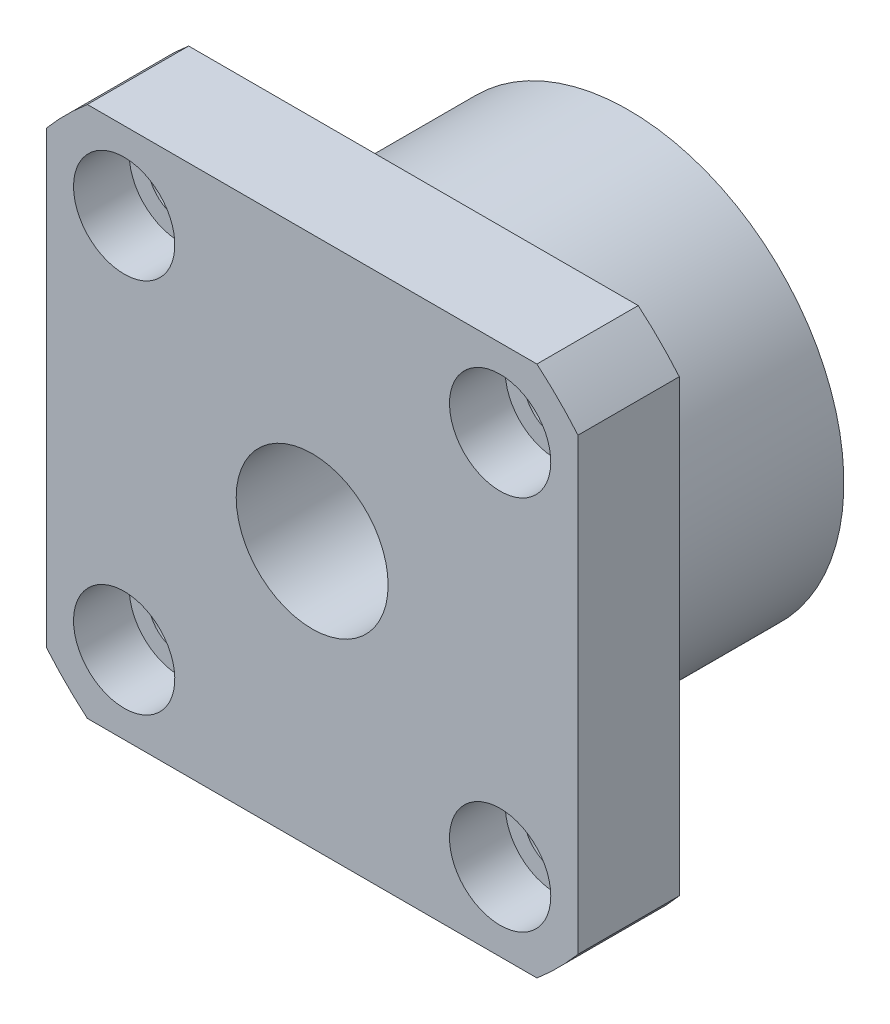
ISO-10303-21;
HEADER;
FILE_DESCRIPTION(('STEP AP214'),'2;1');
FILE_NAME('part.step','',(''),(''),'','','');
FILE_SCHEMA(('AUTOMOTIVE_DESIGN { 1 0 10303 214 1 1 1 1 }'));
ENDSEC;
DATA;
#1=APPLICATION_CONTEXT('core data for automotive mechanical design processes');
#2=APPLICATION_PROTOCOL_DEFINITION('international standard','automotive_design',2000,#1);
#3=PRODUCT_CONTEXT('',#1,'mechanical');
#4=PRODUCT('Part','Part','',(#3));
#5=PRODUCT_RELATED_PRODUCT_CATEGORY('part','',(#4));
#6=PRODUCT_DEFINITION_FORMATION('','',#4);
#7=PRODUCT_DEFINITION_CONTEXT('part definition',#1,'design');
#8=PRODUCT_DEFINITION('design','',#6,#7);
#9=PRODUCT_DEFINITION_SHAPE('','',#8);
#10=(LENGTH_UNIT() NAMED_UNIT(*) SI_UNIT(.MILLI.,.METRE.));
#11=(NAMED_UNIT(*) PLANE_ANGLE_UNIT() SI_UNIT($,.RADIAN.));
#12=(NAMED_UNIT(*) SI_UNIT($,.STERADIAN.) SOLID_ANGLE_UNIT());
#13=UNCERTAINTY_MEASURE_WITH_UNIT(LENGTH_MEASURE(1.E-05),#10,'distance_accuracy_value','');
#14=(GEOMETRIC_REPRESENTATION_CONTEXT(3) GLOBAL_UNCERTAINTY_ASSIGNED_CONTEXT((#13)) GLOBAL_UNIT_ASSIGNED_CONTEXT((#10,
#11,#12)) REPRESENTATION_CONTEXT('',''));
#15=CARTESIAN_POINT('',(0.,0.,0.));
#16=DIRECTION('',(0.,0.,1.));
#17=DIRECTION('',(1.,0.,0.));
#18=AXIS2_PLACEMENT_3D('',#15,#16,#17);
#19=CARTESIAN_POINT('',(0.,0.,0.));
#20=DIRECTION('',(0.,0.,-1.));
#21=DIRECTION('',(-1.,0.,0.));
#22=AXIS2_PLACEMENT_3D('',#19,#20,#21);
#23=PLANE('',#22);
#24=CARTESIAN_POINT('',(-14.8492424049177,-14.8492424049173,0.));
#25=DIRECTION('',(0.,0.,-1.));
#26=DIRECTION('',(0.,-1.,0.));
#27=AXIS2_PLACEMENT_3D('',#24,#25,#26);
#28=CIRCLE('',#27,2.5);
#29=CARTESIAN_POINT('',(-14.8492424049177,-17.3492424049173,0.));
#30=VERTEX_POINT('',#29);
#31=EDGE_CURVE('E155',#30,#30,#28,.T.);
#32=ORIENTED_EDGE('',*,*,#31,.F.);
#33=EDGE_LOOP('',(#32));
#34=FACE_BOUND('',#33,.T.);
#35=CARTESIAN_POINT('',(14.8492424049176,14.8492424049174,0.));
#36=DIRECTION('',(0.,0.,-1.));
#37=DIRECTION('',(0.,1.,0.));
#38=AXIS2_PLACEMENT_3D('',#35,#36,#37);
#39=CIRCLE('',#38,2.5);
#40=CARTESIAN_POINT('',(14.8492424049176,17.3492424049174,0.));
#41=VERTEX_POINT('',#40);
#42=EDGE_CURVE('E181',#41,#41,#39,.T.);
#43=ORIENTED_EDGE('',*,*,#42,.F.);
#44=EDGE_LOOP('',(#43));
#45=FACE_BOUND('',#44,.T.);
#46=CARTESIAN_POINT('',(0.,0.,0.));
#47=DIRECTION('',(0.,0.,-1.));
#48=DIRECTION('',(-1.,0.,0.));
#49=AXIS2_PLACEMENT_3D('',#46,#47,#48);
#50=CIRCLE('',#49,27.5);
#51=CARTESIAN_POINT('',(21.,-17.7552809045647,0.));
#52=VERTEX_POINT('',#51);
#53=CARTESIAN_POINT('',(17.7552809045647,-21.,0.));
#54=VERTEX_POINT('',#53);
#55=EDGE_CURVE('E80',#52,#54,#50,.T.);
#56=ORIENTED_EDGE('',*,*,#55,.T.);
#57=DIRECTION('',(1.,0.,0.));
#58=VECTOR('',#57,1.);
#59=CARTESIAN_POINT('',(-17.7552809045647,-21.,0.));
#60=LINE('',#59,#58);
#61=CARTESIAN_POINT('',(-17.7552809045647,-21.,0.));
#62=VERTEX_POINT('',#61);
#63=EDGE_CURVE('E94',#62,#54,#60,.T.);
#64=ORIENTED_EDGE('',*,*,#63,.F.);
#65=CARTESIAN_POINT('',(0.,0.,0.));
#66=DIRECTION('',(0.,0.,1.));
#67=DIRECTION('',(1.,0.,0.));
#68=AXIS2_PLACEMENT_3D('',#65,#66,#67);
#69=CIRCLE('',#68,27.5);
#70=CARTESIAN_POINT('',(-21.,-17.7552809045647,0.));
#71=VERTEX_POINT('',#70);
#72=EDGE_CURVE('E101',#71,#62,#69,.T.);
#73=ORIENTED_EDGE('',*,*,#72,.F.);
#74=DIRECTION('',(0.,-1.,0.));
#75=VECTOR('',#74,1.);
#76=CARTESIAN_POINT('',(-21.,17.7552809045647,0.));
#77=LINE('',#76,#75);
#78=CARTESIAN_POINT('',(-21.,17.7552809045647,0.));
#79=VERTEX_POINT('',#78);
#80=EDGE_CURVE('E103',#79,#71,#77,.T.);
#81=ORIENTED_EDGE('',*,*,#80,.F.);
#82=CARTESIAN_POINT('',(0.,0.,0.));
#83=DIRECTION('',(0.,0.,-1.));
#84=DIRECTION('',(-1.,0.,0.));
#85=AXIS2_PLACEMENT_3D('',#82,#83,#84);
#86=CIRCLE('',#85,27.5);
#87=CARTESIAN_POINT('',(-17.7552809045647,21.,0.));
#88=VERTEX_POINT('',#87);
#89=EDGE_CURVE('E109',#79,#88,#86,.T.);
#90=ORIENTED_EDGE('',*,*,#89,.T.);
#91=DIRECTION('',(1.,0.,0.));
#92=VECTOR('',#91,1.);
#93=CARTESIAN_POINT('',(-17.7552809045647,21.,0.));
#94=LINE('',#93,#92);
#95=CARTESIAN_POINT('',(17.7552809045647,21.,0.));
#96=VERTEX_POINT('',#95);
#97=EDGE_CURVE('E112',#88,#96,#94,.T.);
#98=ORIENTED_EDGE('',*,*,#97,.T.);
#99=CARTESIAN_POINT('',(0.,0.,0.));
#100=DIRECTION('',(0.,0.,1.));
#101=DIRECTION('',(1.,0.,0.));
#102=AXIS2_PLACEMENT_3D('',#99,#100,#101);
#103=CIRCLE('',#102,27.5);
#104=CARTESIAN_POINT('',(21.,17.7552809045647,0.));
#105=VERTEX_POINT('',#104);
#106=EDGE_CURVE('E115',#105,#96,#103,.T.);
#107=ORIENTED_EDGE('',*,*,#106,.F.);
#108=DIRECTION('',(0.,-1.,0.));
#109=VECTOR('',#108,1.);
#110=CARTESIAN_POINT('',(21.,17.7552809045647,0.));
#111=LINE('',#110,#109);
#112=EDGE_CURVE('E97',#105,#52,#111,.T.);
#113=ORIENTED_EDGE('',*,*,#112,.T.);
#114=EDGE_LOOP('',(#56,#64,#73,#81,#90,#98,#107,#113));
#115=FACE_BOUND('',#114,.T.);
#116=CARTESIAN_POINT('',(-14.8492424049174,14.8492424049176,0.));
#117=DIRECTION('',(0.,0.,-1.));
#118=DIRECTION('',(-1.,0.,0.));
#119=AXIS2_PLACEMENT_3D('',#116,#117,#118);
#120=CIRCLE('',#119,2.5);
#121=CARTESIAN_POINT('',(-17.3492424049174,14.8492424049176,0.));
#122=VERTEX_POINT('',#121);
#123=EDGE_CURVE('E151',#122,#122,#120,.T.);
#124=ORIENTED_EDGE('',*,*,#123,.F.);
#125=EDGE_LOOP('',(#124));
#126=FACE_BOUND('',#125,.T.);
#127=CARTESIAN_POINT('',(14.8492424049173,-14.8492424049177,0.));
#128=DIRECTION('',(0.,0.,-1.));
#129=DIRECTION('',(1.,0.,0.));
#130=AXIS2_PLACEMENT_3D('',#127,#128,#129);
#131=CIRCLE('',#130,2.5);
#132=CARTESIAN_POINT('',(17.3492424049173,-14.8492424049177,0.));
#133=VERTEX_POINT('',#132);
#134=EDGE_CURVE('E178',#133,#133,#131,.T.);
#135=ORIENTED_EDGE('',*,*,#134,.F.);
#136=EDGE_LOOP('',(#135));
#137=FACE_BOUND('',#136,.T.);
#138=CARTESIAN_POINT('',(0.,0.,0.));
#139=DIRECTION('',(0.,0.,-1.));
#140=DIRECTION('',(-1.,0.,0.));
#141=AXIS2_PLACEMENT_3D('',#138,#139,#140);
#142=CIRCLE('',#141,17.);
#143=CARTESIAN_POINT('',(-17.,0.,0.));
#144=VERTEX_POINT('',#143);
#145=EDGE_CURVE('E456',#144,#144,#142,.F.);
#146=ORIENTED_EDGE('',*,*,#145,.T.);
#147=EDGE_LOOP('',(#146));
#148=FACE_BOUND('',#147,.T.);
#149=ADVANCED_FACE('F14',(#34,#45,#115,#126,#137,#148),#23,.T.);
#150=CARTESIAN_POINT('',(0.,0.,8.));
#151=DIRECTION('',(0.,0.,-1.));
#152=DIRECTION('',(-1.,0.,0.));
#153=AXIS2_PLACEMENT_3D('',#150,#151,#152);
#154=PLANE('',#153);
#155=CARTESIAN_POINT('',(14.8492424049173,-14.8492424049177,8.));
#156=DIRECTION('',(0.,0.,-1.));
#157=DIRECTION('',(1.,0.,0.));
#158=AXIS2_PLACEMENT_3D('',#155,#156,#157);
#159=CIRCLE('',#158,4.);
#160=CARTESIAN_POINT('',(18.8492424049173,-14.8492424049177,8.));
#161=VERTEX_POINT('',#160);
#162=EDGE_CURVE('E166',#161,#161,#159,.T.);
#163=ORIENTED_EDGE('',*,*,#162,.T.);
#164=EDGE_LOOP('',(#163));
#165=FACE_BOUND('',#164,.T.);
#166=CARTESIAN_POINT('',(14.8492424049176,14.8492424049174,8.));
#167=DIRECTION('',(0.,0.,-1.));
#168=DIRECTION('',(0.,1.,0.));
#169=AXIS2_PLACEMENT_3D('',#166,#167,#168);
#170=CIRCLE('',#169,4.);
#171=CARTESIAN_POINT('',(14.8492424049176,18.8492424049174,8.));
#172=VERTEX_POINT('',#171);
#173=EDGE_CURVE('E159',#172,#172,#170,.T.);
#174=ORIENTED_EDGE('',*,*,#173,.T.);
#175=EDGE_LOOP('',(#174));
#176=FACE_BOUND('',#175,.T.);
#177=CARTESIAN_POINT('',(-14.8492424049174,14.8492424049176,8.));
#178=DIRECTION('',(0.,0.,-1.));
#179=DIRECTION('',(-1.,0.,0.));
#180=AXIS2_PLACEMENT_3D('',#177,#178,#179);
#181=CIRCLE('',#180,4.);
#182=CARTESIAN_POINT('',(-18.8492424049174,14.8492424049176,8.));
#183=VERTEX_POINT('',#182);
#184=EDGE_CURVE('E184',#183,#183,#181,.T.);
#185=ORIENTED_EDGE('',*,*,#184,.T.);
#186=EDGE_LOOP('',(#185));
#187=FACE_BOUND('',#186,.T.);
#188=CARTESIAN_POINT('',(-14.8492424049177,-14.8492424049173,8.));
#189=DIRECTION('',(0.,0.,-1.));
#190=DIRECTION('',(0.,-1.,0.));
#191=AXIS2_PLACEMENT_3D('',#188,#189,#190);
#192=CIRCLE('',#191,4.);
#193=CARTESIAN_POINT('',(-14.8492424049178,-18.8492424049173,8.));
#194=VERTEX_POINT('',#193);
#195=EDGE_CURVE('E462',#194,#194,#192,.T.);
#196=ORIENTED_EDGE('',*,*,#195,.T.);
#197=EDGE_LOOP('',(#196));
#198=FACE_BOUND('',#197,.T.);
#199=CARTESIAN_POINT('',(0.,0.,8.));
#200=DIRECTION('',(0.,0.,1.));
#201=DIRECTION('',(1.,0.,0.));
#202=AXIS2_PLACEMENT_3D('',#199,#200,#201);
#203=CIRCLE('',#202,6.);
#204=CARTESIAN_POINT('',(6.,0.,8.));
#205=VERTEX_POINT('',#204);
#206=EDGE_CURVE('E98',#205,#205,#203,.T.);
#207=ORIENTED_EDGE('',*,*,#206,.F.);
#208=EDGE_LOOP('',(#207));
#209=FACE_BOUND('',#208,.T.);
#210=CARTESIAN_POINT('',(0.,0.,8.));
#211=DIRECTION('',(0.,0.,-1.));
#212=DIRECTION('',(-1.,0.,0.));
#213=AXIS2_PLACEMENT_3D('',#210,#211,#212);
#214=CIRCLE('',#213,27.5);
#215=CARTESIAN_POINT('',(21.,-17.7552809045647,8.));
#216=VERTEX_POINT('',#215);
#217=CARTESIAN_POINT('',(17.7552809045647,-21.,8.));
#218=VERTEX_POINT('',#217);
#219=EDGE_CURVE('E82',#216,#218,#214,.T.);
#220=ORIENTED_EDGE('',*,*,#219,.F.);
#221=DIRECTION('',(0.,-1.,0.));
#222=VECTOR('',#221,1.);
#223=CARTESIAN_POINT('',(21.,17.7552809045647,8.));
#224=LINE('',#223,#222);
#225=CARTESIAN_POINT('',(21.,17.7552809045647,8.));
#226=VERTEX_POINT('',#225);
#227=EDGE_CURVE('E88',#226,#216,#224,.T.);
#228=ORIENTED_EDGE('',*,*,#227,.F.);
#229=CARTESIAN_POINT('',(0.,0.,8.));
#230=DIRECTION('',(0.,0.,1.));
#231=DIRECTION('',(1.,0.,0.));
#232=AXIS2_PLACEMENT_3D('',#229,#230,#231);
#233=CIRCLE('',#232,27.5);
#234=CARTESIAN_POINT('',(17.7552809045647,21.,8.));
#235=VERTEX_POINT('',#234);
#236=EDGE_CURVE('E134',#226,#235,#233,.T.);
#237=ORIENTED_EDGE('',*,*,#236,.T.);
#238=DIRECTION('',(1.,0.,0.));
#239=VECTOR('',#238,1.);
#240=CARTESIAN_POINT('',(-17.7552809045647,21.,8.));
#241=LINE('',#240,#239);
#242=CARTESIAN_POINT('',(-17.7552809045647,21.,8.));
#243=VERTEX_POINT('',#242);
#244=EDGE_CURVE('E131',#243,#235,#241,.T.);
#245=ORIENTED_EDGE('',*,*,#244,.F.);
#246=CARTESIAN_POINT('',(0.,0.,8.));
#247=DIRECTION('',(0.,0.,-1.));
#248=DIRECTION('',(-1.,0.,0.));
#249=AXIS2_PLACEMENT_3D('',#246,#247,#248);
#250=CIRCLE('',#249,27.5);
#251=CARTESIAN_POINT('',(-21.,17.7552809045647,8.));
#252=VERTEX_POINT('',#251);
#253=EDGE_CURVE('E128',#252,#243,#250,.T.);
#254=ORIENTED_EDGE('',*,*,#253,.F.);
#255=DIRECTION('',(0.,-1.,0.));
#256=VECTOR('',#255,1.);
#257=CARTESIAN_POINT('',(-21.,17.7552809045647,8.));
#258=LINE('',#257,#256);
#259=CARTESIAN_POINT('',(-21.,-17.7552809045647,8.));
#260=VERTEX_POINT('',#259);
#261=EDGE_CURVE('E125',#252,#260,#258,.T.);
#262=ORIENTED_EDGE('',*,*,#261,.T.);
#263=CARTESIAN_POINT('',(0.,0.,8.));
#264=DIRECTION('',(0.,0.,1.));
#265=DIRECTION('',(1.,0.,0.));
#266=AXIS2_PLACEMENT_3D('',#263,#264,#265);
#267=CIRCLE('',#266,27.5);
#268=CARTESIAN_POINT('',(-17.7552809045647,-21.,8.));
#269=VERTEX_POINT('',#268);
#270=EDGE_CURVE('E122',#260,#269,#267,.T.);
#271=ORIENTED_EDGE('',*,*,#270,.T.);
#272=DIRECTION('',(1.,0.,0.));
#273=VECTOR('',#272,1.);
#274=CARTESIAN_POINT('',(-17.7552809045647,-21.,8.));
#275=LINE('',#274,#273);
#276=EDGE_CURVE('E120',#269,#218,#275,.T.);
#277=ORIENTED_EDGE('',*,*,#276,.T.);
#278=EDGE_LOOP('',(#220,#228,#237,#245,#254,#262,#271,#277));
#279=FACE_BOUND('',#278,.T.);
#280=ADVANCED_FACE('F196',(#165,#176,#187,#198,#209,#279),#154,.F.);
#281=CARTESIAN_POINT('',(0.,0.,8.));
#282=DIRECTION('',(0.,0.,-1.));
#283=DIRECTION('',(-1.,0.,0.));
#284=AXIS2_PLACEMENT_3D('',#281,#282,#283);
#285=CYLINDRICAL_SURFACE('',#284,27.5);
#286=DIRECTION('',(0.,0.,-1.));
#287=VECTOR('',#286,1.);
#288=CARTESIAN_POINT('',(21.,-17.7552809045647,8.));
#289=LINE('',#288,#287);
#290=EDGE_CURVE('E9',#216,#52,#289,.T.);
#291=ORIENTED_EDGE('',*,*,#290,.F.);
#292=ORIENTED_EDGE('',*,*,#219,.T.);
#293=DIRECTION('',(0.,0.,-1.));
#294=VECTOR('',#293,1.);
#295=CARTESIAN_POINT('',(17.7552809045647,-21.,8.));
#296=LINE('',#295,#294);
#297=EDGE_CURVE('E77',#218,#54,#296,.T.);
#298=ORIENTED_EDGE('',*,*,#297,.T.);
#299=ORIENTED_EDGE('',*,*,#55,.F.);
#300=EDGE_LOOP('',(#291,#292,#298,#299));
#301=FACE_BOUND('',#300,.T.);
#302=ADVANCED_FACE('F79',(#301),#285,.T.);
#303=CARTESIAN_POINT('',(21.,17.7552809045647,8.));
#304=DIRECTION('',(1.,0.,0.));
#305=DIRECTION('',(0.,0.,-1.));
#306=AXIS2_PLACEMENT_3D('',#303,#304,#305);
#307=PLANE('',#306);
#308=DIRECTION('',(0.,0.,-1.));
#309=VECTOR('',#308,1.);
#310=CARTESIAN_POINT('',(21.,17.7552809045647,8.));
#311=LINE('',#310,#309);
#312=EDGE_CURVE('E23',#226,#105,#311,.T.);
#313=ORIENTED_EDGE('',*,*,#312,.F.);
#314=ORIENTED_EDGE('',*,*,#227,.T.);
#315=ORIENTED_EDGE('',*,*,#290,.T.);
#316=ORIENTED_EDGE('',*,*,#112,.F.);
#317=EDGE_LOOP('',(#313,#314,#315,#316));
#318=FACE_BOUND('',#317,.T.);
#319=ADVANCED_FACE('F16',(#318),#307,.T.);
#320=CARTESIAN_POINT('',(0.,0.,8.));
#321=DIRECTION('',(0.,0.,-1.));
#322=DIRECTION('',(-1.,0.,0.));
#323=AXIS2_PLACEMENT_3D('',#320,#321,#322);
#324=CYLINDRICAL_SURFACE('',#323,27.5);
#325=DIRECTION('',(0.,0.,-1.));
#326=VECTOR('',#325,1.);
#327=CARTESIAN_POINT('',(17.7552809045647,21.,8.));
#328=LINE('',#327,#326);
#329=EDGE_CURVE('E145',#235,#96,#328,.T.);
#330=ORIENTED_EDGE('',*,*,#329,.F.);
#331=ORIENTED_EDGE('',*,*,#236,.F.);
#332=ORIENTED_EDGE('',*,*,#312,.T.);
#333=ORIENTED_EDGE('',*,*,#106,.T.);
#334=EDGE_LOOP('',(#330,#331,#332,#333));
#335=FACE_BOUND('',#334,.T.);
#336=ADVANCED_FACE('F203',(#335),#324,.T.);
#337=CARTESIAN_POINT('',(-17.7552809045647,21.,8.));
#338=DIRECTION('',(0.,1.,0.));
#339=DIRECTION('',(0.,0.,1.));
#340=AXIS2_PLACEMENT_3D('',#337,#338,#339);
#341=PLANE('',#340);
#342=DIRECTION('',(0.,0.,-1.));
#343=VECTOR('',#342,1.);
#344=CARTESIAN_POINT('',(-17.7552809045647,21.,8.));
#345=LINE('',#344,#343);
#346=EDGE_CURVE('E143',#243,#88,#345,.T.);
#347=ORIENTED_EDGE('',*,*,#346,.F.);
#348=ORIENTED_EDGE('',*,*,#244,.T.);
#349=ORIENTED_EDGE('',*,*,#329,.T.);
#350=ORIENTED_EDGE('',*,*,#97,.F.);
#351=EDGE_LOOP('',(#347,#348,#349,#350));
#352=FACE_BOUND('',#351,.T.);
#353=ADVANCED_FACE('F209',(#352),#341,.T.);
#354=CARTESIAN_POINT('',(0.,0.,8.));
#355=DIRECTION('',(0.,0.,-1.));
#356=DIRECTION('',(-1.,0.,0.));
#357=AXIS2_PLACEMENT_3D('',#354,#355,#356);
#358=CYLINDRICAL_SURFACE('',#357,27.5);
#359=DIRECTION('',(0.,0.,-1.));
#360=VECTOR('',#359,1.);
#361=CARTESIAN_POINT('',(-21.,17.7552809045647,8.));
#362=LINE('',#361,#360);
#363=EDGE_CURVE('E141',#252,#79,#362,.T.);
#364=ORIENTED_EDGE('',*,*,#363,.F.);
#365=ORIENTED_EDGE('',*,*,#253,.T.);
#366=ORIENTED_EDGE('',*,*,#346,.T.);
#367=ORIENTED_EDGE('',*,*,#89,.F.);
#368=EDGE_LOOP('',(#364,#365,#366,#367));
#369=FACE_BOUND('',#368,.T.);
#370=ADVANCED_FACE('F231',(#369),#358,.T.);
#371=CARTESIAN_POINT('',(-21.,17.7552809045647,8.));
#372=DIRECTION('',(1.,0.,0.));
#373=DIRECTION('',(0.,0.,-1.));
#374=AXIS2_PLACEMENT_3D('',#371,#372,#373);
#375=PLANE('',#374);
#376=DIRECTION('',(0.,0.,-1.));
#377=VECTOR('',#376,1.);
#378=CARTESIAN_POINT('',(-21.,-17.7552809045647,8.));
#379=LINE('',#378,#377);
#380=EDGE_CURVE('E139',#260,#71,#379,.T.);
#381=ORIENTED_EDGE('',*,*,#380,.F.);
#382=ORIENTED_EDGE('',*,*,#261,.F.);
#383=ORIENTED_EDGE('',*,*,#363,.T.);
#384=ORIENTED_EDGE('',*,*,#80,.T.);
#385=EDGE_LOOP('',(#381,#382,#383,#384));
#386=FACE_BOUND('',#385,.T.);
#387=ADVANCED_FACE('F227',(#386),#375,.F.);
#388=CARTESIAN_POINT('',(0.,0.,8.));
#389=DIRECTION('',(0.,0.,-1.));
#390=DIRECTION('',(-1.,0.,0.));
#391=AXIS2_PLACEMENT_3D('',#388,#389,#390);
#392=CYLINDRICAL_SURFACE('',#391,27.5);
#393=DIRECTION('',(0.,0.,-1.));
#394=VECTOR('',#393,1.);
#395=CARTESIAN_POINT('',(-17.7552809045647,-21.,8.));
#396=LINE('',#395,#394);
#397=EDGE_CURVE('E87',#269,#62,#396,.T.);
#398=ORIENTED_EDGE('',*,*,#397,.F.);
#399=ORIENTED_EDGE('',*,*,#270,.F.);
#400=ORIENTED_EDGE('',*,*,#380,.T.);
#401=ORIENTED_EDGE('',*,*,#72,.T.);
#402=EDGE_LOOP('',(#398,#399,#400,#401));
#403=FACE_BOUND('',#402,.T.);
#404=ADVANCED_FACE('F224',(#403),#392,.T.);
#405=CARTESIAN_POINT('',(-17.7552809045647,-21.,8.));
#406=DIRECTION('',(0.,1.,0.));
#407=DIRECTION('',(0.,0.,1.));
#408=AXIS2_PLACEMENT_3D('',#405,#406,#407);
#409=PLANE('',#408);
#410=ORIENTED_EDGE('',*,*,#276,.F.);
#411=ORIENTED_EDGE('',*,*,#397,.T.);
#412=ORIENTED_EDGE('',*,*,#63,.T.);
#413=ORIENTED_EDGE('',*,*,#297,.F.);
#414=EDGE_LOOP('',(#410,#411,#412,#413));
#415=FACE_BOUND('',#414,.T.);
#416=ADVANCED_FACE('F100',(#415),#409,.F.);
#417=CARTESIAN_POINT('',(0.,0.,8.));
#418=DIRECTION('',(0.,0.,-1.));
#419=DIRECTION('',(-1.,0.,0.));
#420=AXIS2_PLACEMENT_3D('',#417,#418,#419);
#421=CYLINDRICAL_SURFACE('',#420,6.);
#422=ORIENTED_EDGE('',*,*,#206,.T.);
#423=EDGE_LOOP('',(#422));
#424=FACE_BOUND('',#423,.T.);
#425=CARTESIAN_POINT('',(0.,0.,-17.));
#426=DIRECTION('',(0.,0.,-1.));
#427=DIRECTION('',(-1.,0.,0.));
#428=AXIS2_PLACEMENT_3D('',#425,#426,#427);
#429=CIRCLE('',#428,6.);
#430=CARTESIAN_POINT('',(-6.,0.,-17.));
#431=VERTEX_POINT('',#430);
#432=EDGE_CURVE('E460',#431,#431,#429,.T.);
#433=ORIENTED_EDGE('',*,*,#432,.T.);
#434=EDGE_LOOP('',(#433));
#435=FACE_BOUND('',#434,.T.);
#436=ADVANCED_FACE('F193',(#424,#435),#421,.F.);
#437=CARTESIAN_POINT('',(-14.8492424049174,14.8492424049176,0.));
#438=DIRECTION('',(0.,0.,1.));
#439=DIRECTION('',(1.,0.,0.));
#440=AXIS2_PLACEMENT_3D('',#437,#438,#439);
#441=CYLINDRICAL_SURFACE('',#440,2.5);
#442=CARTESIAN_POINT('',(-14.8492424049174,14.8492424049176,3.6));
#443=DIRECTION('',(0.,0.,-1.));
#444=DIRECTION('',(-1.,0.,0.));
#445=AXIS2_PLACEMENT_3D('',#442,#443,#444);
#446=CIRCLE('',#445,2.5);
#447=CARTESIAN_POINT('',(-17.3492424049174,14.8492424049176,3.6));
#448=VERTEX_POINT('',#447);
#449=EDGE_CURVE('E148',#448,#448,#446,.T.);
#450=ORIENTED_EDGE('',*,*,#449,.F.);
#451=EDGE_LOOP('',(#450));
#452=FACE_BOUND('',#451,.T.);
#453=ORIENTED_EDGE('',*,*,#123,.T.);
#454=EDGE_LOOP('',(#453));
#455=FACE_BOUND('',#454,.T.);
#456=ADVANCED_FACE('F278',(#452,#455),#441,.F.);
#457=CARTESIAN_POINT('',(-14.8492424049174,14.8492424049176,3.6));
#458=DIRECTION('',(0.,0.,1.));
#459=DIRECTION('',(1.,0.,0.));
#460=AXIS2_PLACEMENT_3D('',#457,#458,#459);
#461=CYLINDRICAL_SURFACE('',#460,4.);
#462=ORIENTED_EDGE('',*,*,#184,.F.);
#463=EDGE_LOOP('',(#462));
#464=FACE_BOUND('',#463,.T.);
#465=CARTESIAN_POINT('',(-14.8492424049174,14.8492424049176,3.6));
#466=DIRECTION('',(0.,0.,-1.));
#467=DIRECTION('',(-1.,0.,0.));
#468=AXIS2_PLACEMENT_3D('',#465,#466,#467);
#469=CIRCLE('',#468,4.);
#470=CARTESIAN_POINT('',(-18.8492424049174,14.8492424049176,3.6));
#471=VERTEX_POINT('',#470);
#472=EDGE_CURVE('E152',#471,#471,#469,.T.);
#473=ORIENTED_EDGE('',*,*,#472,.T.);
#474=EDGE_LOOP('',(#473));
#475=FACE_BOUND('',#474,.T.);
#476=ADVANCED_FACE('F285',(#464,#475),#461,.F.);
#477=CARTESIAN_POINT('',(-14.8492424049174,14.8492424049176,3.6));
#478=DIRECTION('',(0.,0.,-1.));
#479=DIRECTION('',(-1.,0.,0.));
#480=AXIS2_PLACEMENT_3D('',#477,#478,#479);
#481=PLANE('',#480);
#482=ORIENTED_EDGE('',*,*,#449,.T.);
#483=EDGE_LOOP('',(#482));
#484=FACE_BOUND('',#483,.T.);
#485=ORIENTED_EDGE('',*,*,#472,.F.);
#486=EDGE_LOOP('',(#485));
#487=FACE_BOUND('',#486,.T.);
#488=ADVANCED_FACE('F287',(#484,#487),#481,.F.);
#489=CARTESIAN_POINT('',(14.8492424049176,14.8492424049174,0.));
#490=DIRECTION('',(0.,0.,1.));
#491=DIRECTION('',(1.,0.,0.));
#492=AXIS2_PLACEMENT_3D('',#489,#490,#491);
#493=CYLINDRICAL_SURFACE('',#492,2.5);
#494=CARTESIAN_POINT('',(14.8492424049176,14.8492424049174,3.6));
#495=DIRECTION('',(0.,0.,-1.));
#496=DIRECTION('',(-1.,0.,0.));
#497=AXIS2_PLACEMENT_3D('',#494,#495,#496);
#498=CIRCLE('',#497,2.5);
#499=CARTESIAN_POINT('',(12.3492424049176,14.8492424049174,3.6));
#500=VERTEX_POINT('',#499);
#501=EDGE_CURVE('E153',#500,#500,#498,.T.);
#502=ORIENTED_EDGE('',*,*,#501,.F.);
#503=EDGE_LOOP('',(#502));
#504=FACE_BOUND('',#503,.T.);
#505=ORIENTED_EDGE('',*,*,#42,.T.);
#506=EDGE_LOOP('',(#505));
#507=FACE_BOUND('',#506,.T.);
#508=ADVANCED_FACE('F296',(#504,#507),#493,.F.);
#509=CARTESIAN_POINT('',(14.8492424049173,-14.8492424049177,0.));
#510=DIRECTION('',(0.,0.,1.));
#511=DIRECTION('',(1.,0.,0.));
#512=AXIS2_PLACEMENT_3D('',#509,#510,#511);
#513=CYLINDRICAL_SURFACE('',#512,2.5);
#514=CARTESIAN_POINT('',(14.8492424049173,-14.8492424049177,3.6));
#515=DIRECTION('',(0.,0.,-1.));
#516=DIRECTION('',(-1.,0.,0.));
#517=AXIS2_PLACEMENT_3D('',#514,#515,#516);
#518=CIRCLE('',#517,2.5);
#519=CARTESIAN_POINT('',(12.3492424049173,-14.8492424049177,3.6));
#520=VERTEX_POINT('',#519);
#521=EDGE_CURVE('E157',#520,#520,#518,.T.);
#522=ORIENTED_EDGE('',*,*,#521,.F.);
#523=EDGE_LOOP('',(#522));
#524=FACE_BOUND('',#523,.T.);
#525=ORIENTED_EDGE('',*,*,#134,.T.);
#526=EDGE_LOOP('',(#525));
#527=FACE_BOUND('',#526,.T.);
#528=ADVANCED_FACE('F311',(#524,#527),#513,.F.);
#529=CARTESIAN_POINT('',(-14.8492424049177,-14.8492424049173,0.));
#530=DIRECTION('',(0.,0.,1.));
#531=DIRECTION('',(1.,0.,0.));
#532=AXIS2_PLACEMENT_3D('',#529,#530,#531);
#533=CYLINDRICAL_SURFACE('',#532,2.5);
#534=CARTESIAN_POINT('',(-14.8492424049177,-14.8492424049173,3.6));
#535=DIRECTION('',(0.,0.,-1.));
#536=DIRECTION('',(-1.,0.,0.));
#537=AXIS2_PLACEMENT_3D('',#534,#535,#536);
#538=CIRCLE('',#537,2.5);
#539=CARTESIAN_POINT('',(-17.3492424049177,-14.8492424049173,3.6));
#540=VERTEX_POINT('',#539);
#541=EDGE_CURVE('E18',#540,#540,#538,.T.);
#542=ORIENTED_EDGE('',*,*,#541,.F.);
#543=EDGE_LOOP('',(#542));
#544=FACE_BOUND('',#543,.T.);
#545=ORIENTED_EDGE('',*,*,#31,.T.);
#546=EDGE_LOOP('',(#545));
#547=FACE_BOUND('',#546,.T.);
#548=ADVANCED_FACE('F320',(#544,#547),#533,.F.);
#549=CARTESIAN_POINT('',(14.8492424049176,14.8492424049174,3.6));
#550=DIRECTION('',(0.,0.,1.));
#551=DIRECTION('',(1.,0.,0.));
#552=AXIS2_PLACEMENT_3D('',#549,#550,#551);
#553=CYLINDRICAL_SURFACE('',#552,4.);
#554=ORIENTED_EDGE('',*,*,#173,.F.);
#555=EDGE_LOOP('',(#554));
#556=FACE_BOUND('',#555,.T.);
#557=CARTESIAN_POINT('',(14.8492424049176,14.8492424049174,3.6));
#558=DIRECTION('',(0.,0.,-1.));
#559=DIRECTION('',(0.,1.,0.));
#560=AXIS2_PLACEMENT_3D('',#557,#558,#559);
#561=CIRCLE('',#560,4.);
#562=CARTESIAN_POINT('',(14.8492424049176,18.8492424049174,3.6));
#563=VERTEX_POINT('',#562);
#564=EDGE_CURVE('E156',#563,#563,#561,.T.);
#565=ORIENTED_EDGE('',*,*,#564,.T.);
#566=EDGE_LOOP('',(#565));
#567=FACE_BOUND('',#566,.T.);
#568=ADVANCED_FACE('F329',(#556,#567),#553,.F.);
#569=CARTESIAN_POINT('',(14.8492424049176,14.8492424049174,3.6));
#570=DIRECTION('',(0.,0.,-1.));
#571=DIRECTION('',(0.,1.,0.));
#572=AXIS2_PLACEMENT_3D('',#569,#570,#571);
#573=PLANE('',#572);
#574=ORIENTED_EDGE('',*,*,#501,.T.);
#575=EDGE_LOOP('',(#574));
#576=FACE_BOUND('',#575,.T.);
#577=ORIENTED_EDGE('',*,*,#564,.F.);
#578=EDGE_LOOP('',(#577));
#579=FACE_BOUND('',#578,.T.);
#580=ADVANCED_FACE('F332',(#576,#579),#573,.F.);
#581=CARTESIAN_POINT('',(14.8492424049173,-14.8492424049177,3.6));
#582=DIRECTION('',(0.,0.,1.));
#583=DIRECTION('',(1.,0.,0.));
#584=AXIS2_PLACEMENT_3D('',#581,#582,#583);
#585=CYLINDRICAL_SURFACE('',#584,4.);
#586=ORIENTED_EDGE('',*,*,#162,.F.);
#587=EDGE_LOOP('',(#586));
#588=FACE_BOUND('',#587,.T.);
#589=CARTESIAN_POINT('',(14.8492424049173,-14.8492424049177,3.6));
#590=DIRECTION('',(0.,0.,-1.));
#591=DIRECTION('',(1.,0.,0.));
#592=AXIS2_PLACEMENT_3D('',#589,#590,#591);
#593=CIRCLE('',#592,4.);
#594=CARTESIAN_POINT('',(18.8492424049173,-14.8492424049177,3.6));
#595=VERTEX_POINT('',#594);
#596=EDGE_CURVE('E160',#595,#595,#593,.T.);
#597=ORIENTED_EDGE('',*,*,#596,.T.);
#598=EDGE_LOOP('',(#597));
#599=FACE_BOUND('',#598,.T.);
#600=ADVANCED_FACE('F348',(#588,#599),#585,.F.);
#601=CARTESIAN_POINT('',(14.8492424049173,-14.8492424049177,3.6));
#602=DIRECTION('',(0.,0.,-1.));
#603=DIRECTION('',(1.,0.,0.));
#604=AXIS2_PLACEMENT_3D('',#601,#602,#603);
#605=PLANE('',#604);
#606=ORIENTED_EDGE('',*,*,#521,.T.);
#607=EDGE_LOOP('',(#606));
#608=FACE_BOUND('',#607,.T.);
#609=ORIENTED_EDGE('',*,*,#596,.F.);
#610=EDGE_LOOP('',(#609));
#611=FACE_BOUND('',#610,.T.);
#612=ADVANCED_FACE('F341',(#608,#611),#605,.F.);
#613=CARTESIAN_POINT('',(-14.8492424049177,-14.8492424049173,3.6));
#614=DIRECTION('',(0.,0.,1.));
#615=DIRECTION('',(1.,0.,0.));
#616=AXIS2_PLACEMENT_3D('',#613,#614,#615);
#617=CYLINDRICAL_SURFACE('',#616,4.);
#618=ORIENTED_EDGE('',*,*,#195,.F.);
#619=EDGE_LOOP('',(#618));
#620=FACE_BOUND('',#619,.T.);
#621=CARTESIAN_POINT('',(-14.8492424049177,-14.8492424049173,3.6));
#622=DIRECTION('',(0.,0.,-1.));
#623=DIRECTION('',(0.,-1.,0.));
#624=AXIS2_PLACEMENT_3D('',#621,#622,#623);
#625=CIRCLE('',#624,4.);
#626=CARTESIAN_POINT('',(-14.8492424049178,-18.8492424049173,3.6));
#627=VERTEX_POINT('',#626);
#628=EDGE_CURVE('E468',#627,#627,#625,.T.);
#629=ORIENTED_EDGE('',*,*,#628,.T.);
#630=EDGE_LOOP('',(#629));
#631=FACE_BOUND('',#630,.T.);
#632=ADVANCED_FACE('F366',(#620,#631),#617,.F.);
#633=CARTESIAN_POINT('',(-14.8492424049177,-14.8492424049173,3.6));
#634=DIRECTION('',(0.,0.,-1.));
#635=DIRECTION('',(0.,-1.,0.));
#636=AXIS2_PLACEMENT_3D('',#633,#634,#635);
#637=PLANE('',#636);
#638=ORIENTED_EDGE('',*,*,#541,.T.);
#639=EDGE_LOOP('',(#638));
#640=FACE_BOUND('',#639,.T.);
#641=ORIENTED_EDGE('',*,*,#628,.F.);
#642=EDGE_LOOP('',(#641));
#643=FACE_BOUND('',#642,.T.);
#644=ADVANCED_FACE('F359',(#640,#643),#637,.F.);
#645=CARTESIAN_POINT('',(0.,0.,-17.));
#646=DIRECTION('',(0.,0.,-1.));
#647=DIRECTION('',(-1.,0.,0.));
#648=AXIS2_PLACEMENT_3D('',#645,#646,#647);
#649=PLANE('',#648);
#650=CARTESIAN_POINT('',(0.,0.,-17.));
#651=DIRECTION('',(0.,0.,-1.));
#652=DIRECTION('',(-1.,0.,0.));
#653=AXIS2_PLACEMENT_3D('',#650,#651,#652);
#654=CIRCLE('',#653,17.);
#655=CARTESIAN_POINT('',(-17.,0.,-17.));
#656=VERTEX_POINT('',#655);
#657=EDGE_CURVE('E459',#656,#656,#654,.T.);
#658=ORIENTED_EDGE('',*,*,#657,.T.);
#659=EDGE_LOOP('',(#658));
#660=FACE_BOUND('',#659,.T.);
#661=ORIENTED_EDGE('',*,*,#432,.F.);
#662=EDGE_LOOP('',(#661));
#663=FACE_BOUND('',#662,.T.);
#664=ADVANCED_FACE('F376',(#660,#663),#649,.T.);
#665=CARTESIAN_POINT('',(0.,0.,-17.));
#666=DIRECTION('',(0.,0.,1.));
#667=DIRECTION('',(1.,0.,0.));
#668=AXIS2_PLACEMENT_3D('',#665,#666,#667);
#669=CYLINDRICAL_SURFACE('',#668,17.);
#670=ORIENTED_EDGE('',*,*,#145,.F.);
#671=EDGE_LOOP('',(#670));
#672=FACE_BOUND('',#671,.T.);
#673=ORIENTED_EDGE('',*,*,#657,.F.);
#674=EDGE_LOOP('',(#673));
#675=FACE_BOUND('',#674,.T.);
#676=ADVANCED_FACE('F391',(#672,#675),#669,.T.);
#677=CLOSED_SHELL('',(#149,#280,#302,#319,#336,#353,#370,#387,#404,#416,#436,#456,#476,#488,
#508,#528,#548,#568,#580,#600,#612,#632,#644,#664,#676));
#678=MANIFOLD_SOLID_BREP('B1',#677);
#679=ADVANCED_BREP_SHAPE_REPRESENTATION('',(#18,#678),#14);
#680=SHAPE_DEFINITION_REPRESENTATION(#9,#679);
ENDSEC;
END-ISO-10303-21;
